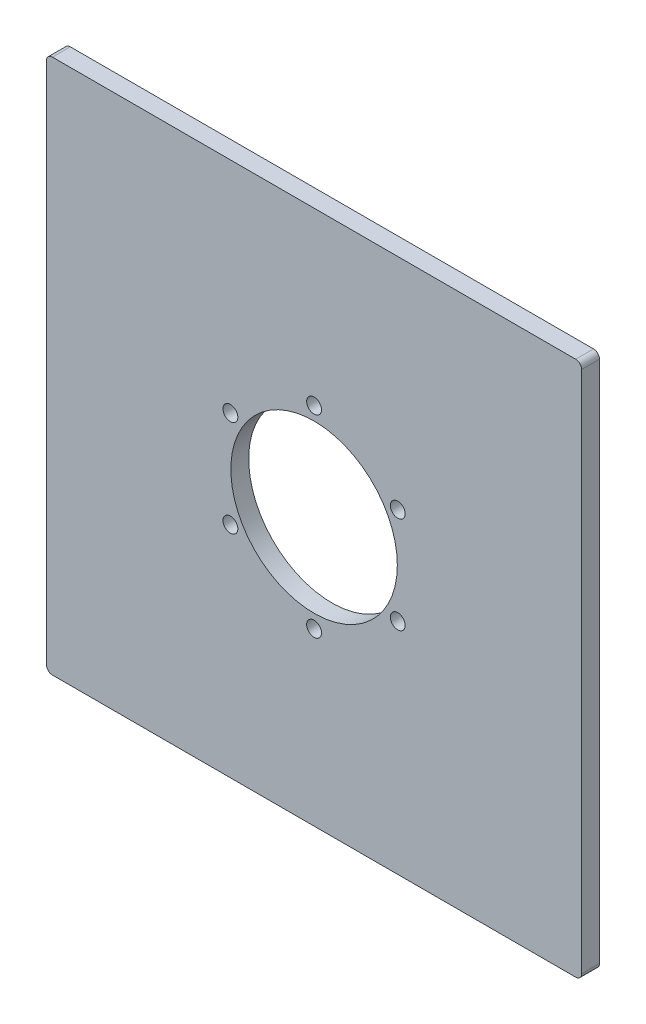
ISO-10303-21;
HEADER;
FILE_DESCRIPTION(('STEP AP214'),'2;1');
FILE_NAME('part.step','',(''),(''),'','','');
FILE_SCHEMA(('AUTOMOTIVE_DESIGN { 1 0 10303 214 1 1 1 1 }'));
ENDSEC;
DATA;
#1=APPLICATION_CONTEXT('core data for automotive mechanical design processes');
#2=APPLICATION_PROTOCOL_DEFINITION('international standard','automotive_design',2000,#1);
#3=PRODUCT_CONTEXT('',#1,'mechanical');
#4=PRODUCT('Part','Part','',(#3));
#5=PRODUCT_RELATED_PRODUCT_CATEGORY('part','',(#4));
#6=PRODUCT_DEFINITION_FORMATION('','',#4);
#7=PRODUCT_DEFINITION_CONTEXT('part definition',#1,'design');
#8=PRODUCT_DEFINITION('design','',#6,#7);
#9=PRODUCT_DEFINITION_SHAPE('','',#8);
#10=(LENGTH_UNIT() NAMED_UNIT(*) SI_UNIT(.MILLI.,.METRE.));
#11=(NAMED_UNIT(*) PLANE_ANGLE_UNIT() SI_UNIT($,.RADIAN.));
#12=(NAMED_UNIT(*) SI_UNIT($,.STERADIAN.) SOLID_ANGLE_UNIT());
#13=UNCERTAINTY_MEASURE_WITH_UNIT(LENGTH_MEASURE(1.E-05),#10,'distance_accuracy_value','');
#14=(GEOMETRIC_REPRESENTATION_CONTEXT(3) GLOBAL_UNCERTAINTY_ASSIGNED_CONTEXT((#13)) GLOBAL_UNIT_ASSIGNED_CONTEXT((#10,
#11,#12)) REPRESENTATION_CONTEXT('',''));
#15=CARTESIAN_POINT('',(0.,0.,0.));
#16=DIRECTION('',(0.,0.,1.));
#17=DIRECTION('',(1.,0.,0.));
#18=AXIS2_PLACEMENT_3D('',#15,#16,#17);
#19=CARTESIAN_POINT('',(114.3,-114.3,7.62));
#20=DIRECTION('',(-1.,0.,0.));
#21=DIRECTION('',(0.,0.,1.));
#22=AXIS2_PLACEMENT_3D('',#19,#20,#21);
#23=PLANE('',#22);
#24=DIRECTION('',(0.,1.,0.));
#25=VECTOR('',#24,1.);
#26=CARTESIAN_POINT('',(114.3,-114.3,7.62));
#27=LINE('',#26,#25);
#28=CARTESIAN_POINT('',(114.3,-111.76,7.62));
#29=VERTEX_POINT('',#28);
#30=CARTESIAN_POINT('',(114.3,111.76,7.62));
#31=VERTEX_POINT('',#30);
#32=EDGE_CURVE('E126',#29,#31,#27,.T.);
#33=ORIENTED_EDGE('',*,*,#32,.F.);
#34=DIRECTION('',(0.,0.,-1.));
#35=VECTOR('',#34,1.);
#36=CARTESIAN_POINT('',(114.3,-111.76,7.62));
#37=LINE('',#36,#35);
#38=CARTESIAN_POINT('',(114.3,-111.76,0.));
#39=VERTEX_POINT('',#38);
#40=EDGE_CURVE('E152',#29,#39,#37,.T.);
#41=ORIENTED_EDGE('',*,*,#40,.T.);
#42=DIRECTION('',(0.,1.,0.));
#43=VECTOR('',#42,1.);
#44=CARTESIAN_POINT('',(114.3,-114.3,0.));
#45=LINE('',#44,#43);
#46=CARTESIAN_POINT('',(114.3,111.76,0.));
#47=VERTEX_POINT('',#46);
#48=EDGE_CURVE('E158',#39,#47,#45,.T.);
#49=ORIENTED_EDGE('',*,*,#48,.T.);
#50=DIRECTION('',(0.,0.,-1.));
#51=VECTOR('',#50,1.);
#52=CARTESIAN_POINT('',(114.3,111.76,7.62));
#53=LINE('',#52,#51);
#54=EDGE_CURVE('E150',#47,#31,#53,.F.);
#55=ORIENTED_EDGE('',*,*,#54,.T.);
#56=EDGE_LOOP('',(#33,#41,#49,#55));
#57=FACE_BOUND('',#56,.T.);
#58=ADVANCED_FACE('F34',(#57),#23,.F.);
#59=CARTESIAN_POINT('',(-114.3,114.3,7.62));
#60=DIRECTION('',(0.,-1.,0.));
#61=DIRECTION('',(0.,0.,-1.));
#62=AXIS2_PLACEMENT_3D('',#59,#60,#61);
#63=PLANE('',#62);
#64=DIRECTION('',(-1.,0.,0.));
#65=VECTOR('',#64,1.);
#66=CARTESIAN_POINT('',(-114.3,114.3,7.62));
#67=LINE('',#66,#65);
#68=CARTESIAN_POINT('',(111.76,114.3,7.62));
#69=VERTEX_POINT('',#68);
#70=CARTESIAN_POINT('',(-111.76,114.3,7.62));
#71=VERTEX_POINT('',#70);
#72=EDGE_CURVE('E129',#69,#71,#67,.T.);
#73=ORIENTED_EDGE('',*,*,#72,.F.);
#74=DIRECTION('',(0.,0.,-1.));
#75=VECTOR('',#74,1.);
#76=CARTESIAN_POINT('',(111.76,114.3,7.62));
#77=LINE('',#76,#75);
#78=CARTESIAN_POINT('',(111.76,114.3,0.));
#79=VERTEX_POINT('',#78);
#80=EDGE_CURVE('E11',#69,#79,#77,.T.);
#81=ORIENTED_EDGE('',*,*,#80,.T.);
#82=DIRECTION('',(-1.,0.,0.));
#83=VECTOR('',#82,1.);
#84=CARTESIAN_POINT('',(-114.3,114.3,0.));
#85=LINE('',#84,#83);
#86=CARTESIAN_POINT('',(-111.76,114.3,0.));
#87=VERTEX_POINT('',#86);
#88=EDGE_CURVE('E131',#79,#87,#85,.T.);
#89=ORIENTED_EDGE('',*,*,#88,.T.);
#90=DIRECTION('',(0.,0.,-1.));
#91=VECTOR('',#90,1.);
#92=CARTESIAN_POINT('',(-111.76,114.3,7.62));
#93=LINE('',#92,#91);
#94=EDGE_CURVE('E42',#87,#71,#93,.F.);
#95=ORIENTED_EDGE('',*,*,#94,.T.);
#96=EDGE_LOOP('',(#73,#81,#89,#95));
#97=FACE_BOUND('',#96,.T.);
#98=ADVANCED_FACE('F239',(#97),#63,.F.);
#99=CARTESIAN_POINT('',(-114.3,-114.3,7.62));
#100=DIRECTION('',(1.,0.,0.));
#101=DIRECTION('',(0.,0.,-1.));
#102=AXIS2_PLACEMENT_3D('',#99,#100,#101);
#103=PLANE('',#102);
#104=DIRECTION('',(0.,-1.,0.));
#105=VECTOR('',#104,1.);
#106=CARTESIAN_POINT('',(-114.3,-114.3,0.));
#107=LINE('',#106,#105);
#108=CARTESIAN_POINT('',(-114.3,111.76,0.));
#109=VERTEX_POINT('',#108);
#110=CARTESIAN_POINT('',(-114.3,-111.76,0.));
#111=VERTEX_POINT('',#110);
#112=EDGE_CURVE('E127',#109,#111,#107,.T.);
#113=ORIENTED_EDGE('',*,*,#112,.T.);
#114=DIRECTION('',(0.,0.,-1.));
#115=VECTOR('',#114,1.);
#116=CARTESIAN_POINT('',(-114.3,-111.76,7.62));
#117=LINE('',#116,#115);
#118=CARTESIAN_POINT('',(-114.3,-111.76,7.62));
#119=VERTEX_POINT('',#118);
#120=EDGE_CURVE('E105',#111,#119,#117,.F.);
#121=ORIENTED_EDGE('',*,*,#120,.T.);
#122=DIRECTION('',(0.,-1.,0.));
#123=VECTOR('',#122,1.);
#124=CARTESIAN_POINT('',(-114.3,-114.3,7.62));
#125=LINE('',#124,#123);
#126=CARTESIAN_POINT('',(-114.3,111.76,7.62));
#127=VERTEX_POINT('',#126);
#128=EDGE_CURVE('E170',#127,#119,#125,.T.);
#129=ORIENTED_EDGE('',*,*,#128,.F.);
#130=DIRECTION('',(0.,0.,-1.));
#131=VECTOR('',#130,1.);
#132=CARTESIAN_POINT('',(-114.3,111.76,7.62));
#133=LINE('',#132,#131);
#134=EDGE_CURVE('E110',#127,#109,#133,.T.);
#135=ORIENTED_EDGE('',*,*,#134,.T.);
#136=EDGE_LOOP('',(#113,#121,#129,#135));
#137=FACE_BOUND('',#136,.T.);
#138=ADVANCED_FACE('F237',(#137),#103,.F.);
#139=CARTESIAN_POINT('',(-114.3,-114.3,7.62));
#140=DIRECTION('',(0.,1.,0.));
#141=DIRECTION('',(0.,0.,1.));
#142=AXIS2_PLACEMENT_3D('',#139,#140,#141);
#143=PLANE('',#142);
#144=DIRECTION('',(1.,0.,0.));
#145=VECTOR('',#144,1.);
#146=CARTESIAN_POINT('',(-114.3,-114.3,7.62));
#147=LINE('',#146,#145);
#148=CARTESIAN_POINT('',(-111.76,-114.3,7.62));
#149=VERTEX_POINT('',#148);
#150=CARTESIAN_POINT('',(111.76,-114.3,7.62));
#151=VERTEX_POINT('',#150);
#152=EDGE_CURVE('E120',#149,#151,#147,.T.);
#153=ORIENTED_EDGE('',*,*,#152,.F.);
#154=DIRECTION('',(0.,0.,-1.));
#155=VECTOR('',#154,1.);
#156=CARTESIAN_POINT('',(-111.76,-114.3,7.62));
#157=LINE('',#156,#155);
#158=CARTESIAN_POINT('',(-111.76,-114.3,0.));
#159=VERTEX_POINT('',#158);
#160=EDGE_CURVE('E104',#149,#159,#157,.T.);
#161=ORIENTED_EDGE('',*,*,#160,.T.);
#162=DIRECTION('',(1.,0.,0.));
#163=VECTOR('',#162,1.);
#164=CARTESIAN_POINT('',(-114.3,-114.3,0.));
#165=LINE('',#164,#163);
#166=CARTESIAN_POINT('',(111.76,-114.3,0.));
#167=VERTEX_POINT('',#166);
#168=EDGE_CURVE('E117',#159,#167,#165,.T.);
#169=ORIENTED_EDGE('',*,*,#168,.T.);
#170=DIRECTION('',(0.,0.,-1.));
#171=VECTOR('',#170,1.);
#172=CARTESIAN_POINT('',(111.76,-114.3,7.62));
#173=LINE('',#172,#171);
#174=EDGE_CURVE('E122',#167,#151,#173,.F.);
#175=ORIENTED_EDGE('',*,*,#174,.T.);
#176=EDGE_LOOP('',(#153,#161,#169,#175));
#177=FACE_BOUND('',#176,.T.);
#178=ADVANCED_FACE('F116',(#177),#143,.F.);
#179=CARTESIAN_POINT('',(0.,0.,7.62));
#180=DIRECTION('',(0.,0.,-1.));
#181=DIRECTION('',(-1.,0.,0.));
#182=AXIS2_PLACEMENT_3D('',#179,#180,#181);
#183=PLANE('',#182);
#184=CARTESIAN_POINT('',(35.7451985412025,20.6375000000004,7.62));
#185=DIRECTION('',(0.,0.,1.));
#186=DIRECTION('',(0.50000000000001,-0.866025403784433,0.));
#187=AXIS2_PLACEMENT_3D('',#184,#185,#186);
#188=CIRCLE('',#187,3.175);
#189=CARTESIAN_POINT('',(38.9201985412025,20.6375000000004,7.62));
#190=VERTEX_POINT('',#189);
#191=EDGE_CURVE('E189',#190,#190,#188,.T.);
#192=ORIENTED_EDGE('',*,*,#191,.F.);
#193=EDGE_LOOP('',(#192));
#194=FACE_BOUND('',#193,.T.);
#195=CARTESIAN_POINT('',(35.7451985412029,-20.6374999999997,7.62));
#196=DIRECTION('',(0.,0.,1.));
#197=DIRECTION('',(-0.499999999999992,-0.866025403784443,0.));
#198=AXIS2_PLACEMENT_3D('',#195,#196,#197);
#199=CIRCLE('',#198,3.175);
#200=CARTESIAN_POINT('',(38.9201985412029,-20.6374999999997,7.62));
#201=VERTEX_POINT('',#200);
#202=EDGE_CURVE('E195',#201,#201,#199,.T.);
#203=ORIENTED_EDGE('',*,*,#202,.F.);
#204=EDGE_LOOP('',(#203));
#205=FACE_BOUND('',#204,.T.);
#206=CARTESIAN_POINT('',(0.,-41.275,7.62));
#207=DIRECTION('',(0.,0.,1.));
#208=DIRECTION('',(-1.,0.,0.));
#209=AXIS2_PLACEMENT_3D('',#206,#207,#208);
#210=CIRCLE('',#209,3.175);
#211=CARTESIAN_POINT('',(3.175,-41.275,7.62));
#212=VERTEX_POINT('',#211);
#213=EDGE_CURVE('E201',#212,#212,#210,.T.);
#214=ORIENTED_EDGE('',*,*,#213,.F.);
#215=EDGE_LOOP('',(#214));
#216=FACE_BOUND('',#215,.T.);
#217=CARTESIAN_POINT('',(-35.7451985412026,-20.6375000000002,7.62));
#218=DIRECTION('',(0.,0.,1.));
#219=DIRECTION('',(-0.500000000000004,0.866025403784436,0.));
#220=AXIS2_PLACEMENT_3D('',#217,#218,#219);
#221=CIRCLE('',#220,3.175);
#222=CARTESIAN_POINT('',(-32.5701985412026,-20.6375000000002,7.62));
#223=VERTEX_POINT('',#222);
#224=EDGE_CURVE('E207',#223,#223,#221,.T.);
#225=ORIENTED_EDGE('',*,*,#224,.F.);
#226=EDGE_LOOP('',(#225));
#227=FACE_BOUND('',#226,.T.);
#228=CARTESIAN_POINT('',(-35.7451985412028,20.6374999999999,7.62));
#229=DIRECTION('',(0.,0.,1.));
#230=DIRECTION('',(0.499999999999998,0.86602540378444,0.));
#231=AXIS2_PLACEMENT_3D('',#228,#229,#230);
#232=CIRCLE('',#231,3.175);
#233=CARTESIAN_POINT('',(-32.5701985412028,20.6374999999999,7.62));
#234=VERTEX_POINT('',#233);
#235=EDGE_CURVE('E183',#234,#234,#232,.T.);
#236=ORIENTED_EDGE('',*,*,#235,.F.);
#237=EDGE_LOOP('',(#236));
#238=FACE_BOUND('',#237,.T.);
#239=CARTESIAN_POINT('',(0.,41.275,7.62));
#240=DIRECTION('',(0.,0.,1.));
#241=DIRECTION('',(1.,0.,0.));
#242=AXIS2_PLACEMENT_3D('',#239,#240,#241);
#243=CIRCLE('',#242,3.175);
#244=CARTESIAN_POINT('',(3.175,41.275,7.62));
#245=VERTEX_POINT('',#244);
#246=EDGE_CURVE('E177',#245,#245,#243,.T.);
#247=ORIENTED_EDGE('',*,*,#246,.F.);
#248=EDGE_LOOP('',(#247));
#249=FACE_BOUND('',#248,.T.);
#250=CARTESIAN_POINT('',(0.,0.,7.62));
#251=DIRECTION('',(0.,0.,1.));
#252=DIRECTION('',(1.,0.,0.));
#253=AXIS2_PLACEMENT_3D('',#250,#251,#252);
#254=CIRCLE('',#253,35.56);
#255=CARTESIAN_POINT('',(35.56,0.,7.62));
#256=VERTEX_POINT('',#255);
#257=EDGE_CURVE('E166',#256,#256,#254,.T.);
#258=ORIENTED_EDGE('',*,*,#257,.F.);
#259=EDGE_LOOP('',(#258));
#260=FACE_BOUND('',#259,.T.);
#261=ORIENTED_EDGE('',*,*,#128,.T.);
#262=CARTESIAN_POINT('',(-111.76,-111.76,7.62));
#263=DIRECTION('',(0.,0.,-1.));
#264=DIRECTION('',(-1.,0.,0.));
#265=AXIS2_PLACEMENT_3D('',#262,#263,#264);
#266=CIRCLE('',#265,2.54);
#267=EDGE_CURVE('E148',#119,#149,#266,.F.);
#268=ORIENTED_EDGE('',*,*,#267,.T.);
#269=ORIENTED_EDGE('',*,*,#152,.T.);
#270=CARTESIAN_POINT('',(111.76,-111.76,7.62));
#271=DIRECTION('',(0.,0.,-1.));
#272=DIRECTION('',(-1.,0.,0.));
#273=AXIS2_PLACEMENT_3D('',#270,#271,#272);
#274=CIRCLE('',#273,2.54);
#275=EDGE_CURVE('E146',#151,#29,#274,.F.);
#276=ORIENTED_EDGE('',*,*,#275,.T.);
#277=ORIENTED_EDGE('',*,*,#32,.T.);
#278=CARTESIAN_POINT('',(111.76,111.76,7.62));
#279=DIRECTION('',(0.,0.,-1.));
#280=DIRECTION('',(-1.,0.,0.));
#281=AXIS2_PLACEMENT_3D('',#278,#279,#280);
#282=CIRCLE('',#281,2.54);
#283=EDGE_CURVE('E55',#31,#69,#282,.F.);
#284=ORIENTED_EDGE('',*,*,#283,.T.);
#285=ORIENTED_EDGE('',*,*,#72,.T.);
#286=CARTESIAN_POINT('',(-111.76,111.76,7.62));
#287=DIRECTION('',(0.,0.,-1.));
#288=DIRECTION('',(-1.,0.,0.));
#289=AXIS2_PLACEMENT_3D('',#286,#287,#288);
#290=CIRCLE('',#289,2.54);
#291=EDGE_CURVE('E143',#71,#127,#290,.F.);
#292=ORIENTED_EDGE('',*,*,#291,.T.);
#293=EDGE_LOOP('',(#261,#268,#269,#276,#277,#284,#285,#292));
#294=FACE_BOUND('',#293,.T.);
#295=ADVANCED_FACE('F223',(#194,#205,#216,#227,#238,#249,#260,#294),#183,.F.);
#296=CARTESIAN_POINT('',(0.,0.,0.));
#297=DIRECTION('',(0.,0.,-1.));
#298=DIRECTION('',(-1.,0.,0.));
#299=AXIS2_PLACEMENT_3D('',#296,#297,#298);
#300=PLANE('',#299);
#301=CARTESIAN_POINT('',(35.7451985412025,20.6375000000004,0.));
#302=DIRECTION('',(0.,0.,1.));
#303=DIRECTION('',(0.50000000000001,-0.866025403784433,0.));
#304=AXIS2_PLACEMENT_3D('',#301,#302,#303);
#305=CIRCLE('',#304,3.175);
#306=CARTESIAN_POINT('',(38.9201985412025,20.6375000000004,0.));
#307=VERTEX_POINT('',#306);
#308=EDGE_CURVE('E192',#307,#307,#305,.T.);
#309=ORIENTED_EDGE('',*,*,#308,.T.);
#310=EDGE_LOOP('',(#309));
#311=FACE_BOUND('',#310,.T.);
#312=CARTESIAN_POINT('',(35.7451985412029,-20.6374999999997,0.));
#313=DIRECTION('',(0.,0.,1.));
#314=DIRECTION('',(-0.499999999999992,-0.866025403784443,0.));
#315=AXIS2_PLACEMENT_3D('',#312,#313,#314);
#316=CIRCLE('',#315,3.175);
#317=CARTESIAN_POINT('',(38.9201985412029,-20.6374999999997,0.));
#318=VERTEX_POINT('',#317);
#319=EDGE_CURVE('E198',#318,#318,#316,.T.);
#320=ORIENTED_EDGE('',*,*,#319,.T.);
#321=EDGE_LOOP('',(#320));
#322=FACE_BOUND('',#321,.T.);
#323=CARTESIAN_POINT('',(0.,-41.275,0.));
#324=DIRECTION('',(0.,0.,1.));
#325=DIRECTION('',(-1.,0.,0.));
#326=AXIS2_PLACEMENT_3D('',#323,#324,#325);
#327=CIRCLE('',#326,3.175);
#328=CARTESIAN_POINT('',(3.175,-41.275,0.));
#329=VERTEX_POINT('',#328);
#330=EDGE_CURVE('E204',#329,#329,#327,.T.);
#331=ORIENTED_EDGE('',*,*,#330,.T.);
#332=EDGE_LOOP('',(#331));
#333=FACE_BOUND('',#332,.T.);
#334=CARTESIAN_POINT('',(-35.7451985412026,-20.6375000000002,0.));
#335=DIRECTION('',(0.,0.,1.));
#336=DIRECTION('',(-0.500000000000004,0.866025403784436,0.));
#337=AXIS2_PLACEMENT_3D('',#334,#335,#336);
#338=CIRCLE('',#337,3.175);
#339=CARTESIAN_POINT('',(-32.5701985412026,-20.6375000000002,0.));
#340=VERTEX_POINT('',#339);
#341=EDGE_CURVE('E186',#340,#340,#338,.T.);
#342=ORIENTED_EDGE('',*,*,#341,.T.);
#343=EDGE_LOOP('',(#342));
#344=FACE_BOUND('',#343,.T.);
#345=CARTESIAN_POINT('',(-35.7451985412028,20.6374999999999,0.));
#346=DIRECTION('',(0.,0.,1.));
#347=DIRECTION('',(0.499999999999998,0.86602540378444,0.));
#348=AXIS2_PLACEMENT_3D('',#345,#346,#347);
#349=CIRCLE('',#348,3.175);
#350=CARTESIAN_POINT('',(-32.5701985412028,20.6374999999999,0.));
#351=VERTEX_POINT('',#350);
#352=EDGE_CURVE('E180',#351,#351,#349,.T.);
#353=ORIENTED_EDGE('',*,*,#352,.T.);
#354=EDGE_LOOP('',(#353));
#355=FACE_BOUND('',#354,.T.);
#356=CARTESIAN_POINT('',(0.,41.275,0.));
#357=DIRECTION('',(0.,0.,1.));
#358=DIRECTION('',(1.,0.,0.));
#359=AXIS2_PLACEMENT_3D('',#356,#357,#358);
#360=CIRCLE('',#359,3.175);
#361=CARTESIAN_POINT('',(3.175,41.275,0.));
#362=VERTEX_POINT('',#361);
#363=EDGE_CURVE('E175',#362,#362,#360,.T.);
#364=ORIENTED_EDGE('',*,*,#363,.T.);
#365=EDGE_LOOP('',(#364));
#366=FACE_BOUND('',#365,.T.);
#367=CARTESIAN_POINT('',(0.,0.,0.));
#368=DIRECTION('',(0.,0.,1.));
#369=DIRECTION('',(1.,0.,0.));
#370=AXIS2_PLACEMENT_3D('',#367,#368,#369);
#371=CIRCLE('',#370,35.56);
#372=CARTESIAN_POINT('',(35.56,0.,0.));
#373=VERTEX_POINT('',#372);
#374=EDGE_CURVE('E163',#373,#373,#371,.T.);
#375=ORIENTED_EDGE('',*,*,#374,.T.);
#376=EDGE_LOOP('',(#375));
#377=FACE_BOUND('',#376,.T.);
#378=ORIENTED_EDGE('',*,*,#168,.F.);
#379=CARTESIAN_POINT('',(-111.76,-111.76,0.));
#380=DIRECTION('',(0.,0.,-1.));
#381=DIRECTION('',(-1.,0.,0.));
#382=AXIS2_PLACEMENT_3D('',#379,#380,#381);
#383=CIRCLE('',#382,2.54);
#384=EDGE_CURVE('E100',#159,#111,#383,.T.);
#385=ORIENTED_EDGE('',*,*,#384,.T.);
#386=ORIENTED_EDGE('',*,*,#112,.F.);
#387=CARTESIAN_POINT('',(-111.76,111.76,0.));
#388=DIRECTION('',(0.,0.,-1.));
#389=DIRECTION('',(-1.,0.,0.));
#390=AXIS2_PLACEMENT_3D('',#387,#388,#389);
#391=CIRCLE('',#390,2.54);
#392=EDGE_CURVE('E121',#109,#87,#391,.T.);
#393=ORIENTED_EDGE('',*,*,#392,.T.);
#394=ORIENTED_EDGE('',*,*,#88,.F.);
#395=CARTESIAN_POINT('',(111.76,111.76,0.));
#396=DIRECTION('',(0.,0.,-1.));
#397=DIRECTION('',(-1.,0.,0.));
#398=AXIS2_PLACEMENT_3D('',#395,#396,#397);
#399=CIRCLE('',#398,2.54);
#400=EDGE_CURVE('E137',#79,#47,#399,.T.);
#401=ORIENTED_EDGE('',*,*,#400,.T.);
#402=ORIENTED_EDGE('',*,*,#48,.F.);
#403=CARTESIAN_POINT('',(111.76,-111.76,0.));
#404=DIRECTION('',(0.,0.,-1.));
#405=DIRECTION('',(-1.,0.,0.));
#406=AXIS2_PLACEMENT_3D('',#403,#404,#405);
#407=CIRCLE('',#406,2.54);
#408=EDGE_CURVE('E111',#39,#167,#407,.T.);
#409=ORIENTED_EDGE('',*,*,#408,.T.);
#410=EDGE_LOOP('',(#378,#385,#386,#393,#394,#401,#402,#409));
#411=FACE_BOUND('',#410,.T.);
#412=ADVANCED_FACE('F124',(#311,#322,#333,#344,#355,#366,#377,#411),#300,.T.);
#413=CARTESIAN_POINT('',(-111.76,-111.76,7.62));
#414=DIRECTION('',(0.,0.,-1.));
#415=DIRECTION('',(-1.,0.,0.));
#416=AXIS2_PLACEMENT_3D('',#413,#414,#415);
#417=CYLINDRICAL_SURFACE('',#416,2.54);
#418=ORIENTED_EDGE('',*,*,#267,.F.);
#419=ORIENTED_EDGE('',*,*,#120,.F.);
#420=ORIENTED_EDGE('',*,*,#384,.F.);
#421=ORIENTED_EDGE('',*,*,#160,.F.);
#422=EDGE_LOOP('',(#418,#419,#420,#421));
#423=FACE_BOUND('',#422,.T.);
#424=ADVANCED_FACE('F103',(#423),#417,.T.);
#425=CARTESIAN_POINT('',(111.76,-111.76,7.62));
#426=DIRECTION('',(0.,0.,-1.));
#427=DIRECTION('',(-1.,0.,0.));
#428=AXIS2_PLACEMENT_3D('',#425,#426,#427);
#429=CYLINDRICAL_SURFACE('',#428,2.54);
#430=ORIENTED_EDGE('',*,*,#275,.F.);
#431=ORIENTED_EDGE('',*,*,#174,.F.);
#432=ORIENTED_EDGE('',*,*,#408,.F.);
#433=ORIENTED_EDGE('',*,*,#40,.F.);
#434=EDGE_LOOP('',(#430,#431,#432,#433));
#435=FACE_BOUND('',#434,.T.);
#436=ADVANCED_FACE('F243',(#435),#429,.T.);
#437=CARTESIAN_POINT('',(111.76,111.76,7.62));
#438=DIRECTION('',(0.,0.,-1.));
#439=DIRECTION('',(-1.,0.,0.));
#440=AXIS2_PLACEMENT_3D('',#437,#438,#439);
#441=CYLINDRICAL_SURFACE('',#440,2.54);
#442=ORIENTED_EDGE('',*,*,#283,.F.);
#443=ORIENTED_EDGE('',*,*,#54,.F.);
#444=ORIENTED_EDGE('',*,*,#400,.F.);
#445=ORIENTED_EDGE('',*,*,#80,.F.);
#446=EDGE_LOOP('',(#442,#443,#444,#445));
#447=FACE_BOUND('',#446,.T.);
#448=ADVANCED_FACE('F242',(#447),#441,.T.);
#449=CARTESIAN_POINT('',(-111.76,111.76,7.62));
#450=DIRECTION('',(0.,0.,-1.));
#451=DIRECTION('',(-1.,0.,0.));
#452=AXIS2_PLACEMENT_3D('',#449,#450,#451);
#453=CYLINDRICAL_SURFACE('',#452,2.54);
#454=ORIENTED_EDGE('',*,*,#291,.F.);
#455=ORIENTED_EDGE('',*,*,#94,.F.);
#456=ORIENTED_EDGE('',*,*,#392,.F.);
#457=ORIENTED_EDGE('',*,*,#134,.F.);
#458=EDGE_LOOP('',(#454,#455,#456,#457));
#459=FACE_BOUND('',#458,.T.);
#460=ADVANCED_FACE('F36',(#459),#453,.T.);
#461=CARTESIAN_POINT('',(0.,0.,0.));
#462=DIRECTION('',(0.,0.,1.));
#463=DIRECTION('',(1.,0.,0.));
#464=AXIS2_PLACEMENT_3D('',#461,#462,#463);
#465=CYLINDRICAL_SURFACE('',#464,35.56);
#466=CARTESIAN_POINT('',(35.56,0.,0.));
#467=CARTESIAN_POINT('',(35.56,0.,0.0793749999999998));
#468=CARTESIAN_POINT('',(35.56,0.,0.15875));
#469=CARTESIAN_POINT('',(35.56,0.,0.3175));
#470=CARTESIAN_POINT('',(35.56,0.,0.396875));
#471=CARTESIAN_POINT('',(35.56,0.,0.555625));
#472=CARTESIAN_POINT('',(35.56,0.,0.635));
#473=CARTESIAN_POINT('',(35.56,0.,0.79375));
#474=CARTESIAN_POINT('',(35.56,0.,0.873125));
#475=CARTESIAN_POINT('',(35.56,0.,1.031875));
#476=CARTESIAN_POINT('',(35.56,0.,1.11125));
#477=CARTESIAN_POINT('',(35.56,0.,1.27));
#478=CARTESIAN_POINT('',(35.56,0.,1.349375));
#479=CARTESIAN_POINT('',(35.56,0.,1.508125));
#480=CARTESIAN_POINT('',(35.56,0.,1.5875));
#481=CARTESIAN_POINT('',(35.56,0.,1.74625));
#482=CARTESIAN_POINT('',(35.56,0.,1.825625));
#483=CARTESIAN_POINT('',(35.56,0.,1.984375));
#484=CARTESIAN_POINT('',(35.56,0.,2.06375));
#485=CARTESIAN_POINT('',(35.56,0.,2.2225));
#486=CARTESIAN_POINT('',(35.56,0.,2.301875));
#487=CARTESIAN_POINT('',(35.56,0.,2.460625));
#488=CARTESIAN_POINT('',(35.56,0.,2.54));
#489=CARTESIAN_POINT('',(35.56,0.,2.69875));
#490=CARTESIAN_POINT('',(35.56,0.,2.778125));
#491=CARTESIAN_POINT('',(35.56,0.,2.936875));
#492=CARTESIAN_POINT('',(35.56,0.,3.01625));
#493=CARTESIAN_POINT('',(35.56,0.,3.175));
#494=CARTESIAN_POINT('',(35.56,0.,3.254375));
#495=CARTESIAN_POINT('',(35.56,0.,3.413125));
#496=CARTESIAN_POINT('',(35.56,0.,3.4925));
#497=CARTESIAN_POINT('',(35.56,0.,3.65125));
#498=CARTESIAN_POINT('',(35.56,0.,3.730625));
#499=CARTESIAN_POINT('',(35.56,0.,3.889375));
#500=CARTESIAN_POINT('',(35.56,0.,3.96875));
#501=CARTESIAN_POINT('',(35.56,0.,4.1275));
#502=CARTESIAN_POINT('',(35.56,0.,4.206875));
#503=CARTESIAN_POINT('',(35.56,0.,4.365625));
#504=CARTESIAN_POINT('',(35.56,0.,4.445));
#505=CARTESIAN_POINT('',(35.56,0.,4.60375));
#506=CARTESIAN_POINT('',(35.56,0.,4.683125));
#507=CARTESIAN_POINT('',(35.56,0.,4.841875));
#508=CARTESIAN_POINT('',(35.56,0.,4.92125));
#509=CARTESIAN_POINT('',(35.56,0.,5.08));
#510=CARTESIAN_POINT('',(35.56,0.,5.159375));
#511=CARTESIAN_POINT('',(35.56,0.,5.318125));
#512=CARTESIAN_POINT('',(35.56,0.,5.3975));
#513=CARTESIAN_POINT('',(35.56,0.,5.55625));
#514=CARTESIAN_POINT('',(35.56,0.,5.635625));
#515=CARTESIAN_POINT('',(35.56,0.,5.794375));
#516=CARTESIAN_POINT('',(35.56,0.,5.87375));
#517=CARTESIAN_POINT('',(35.56,0.,6.0325));
#518=CARTESIAN_POINT('',(35.56,0.,6.111875));
#519=CARTESIAN_POINT('',(35.56,0.,6.270625));
#520=CARTESIAN_POINT('',(35.56,0.,6.35));
#521=CARTESIAN_POINT('',(35.56,0.,6.50875));
#522=CARTESIAN_POINT('',(35.56,0.,6.588125));
#523=CARTESIAN_POINT('',(35.56,0.,6.746875));
#524=CARTESIAN_POINT('',(35.56,0.,6.82625));
#525=CARTESIAN_POINT('',(35.56,0.,6.985));
#526=CARTESIAN_POINT('',(35.56,0.,7.064375));
#527=CARTESIAN_POINT('',(35.56,0.,7.223125));
#528=CARTESIAN_POINT('',(35.56,0.,7.3025));
#529=CARTESIAN_POINT('',(35.56,0.,7.46125));
#530=CARTESIAN_POINT('',(35.56,0.,7.540625));
#531=CARTESIAN_POINT('',(35.56,0.,7.62));
#532=B_SPLINE_CURVE_WITH_KNOTS('',3,(#466,#467,#468,#469,#470,#471,#472,#473,#474,#475,#476,
#477,#478,#479,#480,#481,#482,#483,#484,#485,#486,#487,#488,#489,#490,#491,#492,#493,#494,#495,
#496,#497,#498,#499,#500,#501,#502,#503,#504,#505,#506,#507,#508,#509,#510,#511,#512,#513,#514,
#515,#516,#517,#518,#519,#520,#521,#522,#523,#524,#525,#526,#527,#528,#529,#530,#531),
.UNSPECIFIED.,.F.,.F.,(4,2,2,2,2,2,2,2,2,2,2,2,2,2,2,2,2,2,2,2,2,2,2,2,2,2,2,2,2,2,2,2,4),(0.,
0.238125,0.47625,0.714375,0.9525,1.190625,1.42875,1.666875,1.905,2.143125,2.38125,2.619375,
2.8575,3.095625,3.33375,3.571875,3.81,4.048125,4.28625,4.524375,4.7625,5.000625,5.23875,
5.476875,5.715,5.953125,6.19125,6.429375,6.6675,6.905625,7.14375,7.381875,7.62),.UNSPECIFIED.);
#533=EDGE_CURVE('BSEAM265',#373,#256,#532,.T.);
#534=ORIENTED_EDGE('',*,*,#374,.F.);
#535=ORIENTED_EDGE('',*,*,#257,.T.);
#536=ORIENTED_EDGE('',*,*,#533,.T.);
#537=ORIENTED_EDGE('',*,*,#533,.F.);
#538=EDGE_LOOP('',(#534,#536,#535,#537));
#539=FACE_BOUND('',#538,.T.);
#540=ADVANCED_FACE('F265',(#539),#465,.F.);
#541=CARTESIAN_POINT('',(0.,41.275,0.));
#542=DIRECTION('',(0.,0.,1.));
#543=DIRECTION('',(1.,0.,0.));
#544=AXIS2_PLACEMENT_3D('',#541,#542,#543);
#545=CYLINDRICAL_SURFACE('',#544,3.175);
#546=CARTESIAN_POINT('',(3.175,41.275,0.));
#547=CARTESIAN_POINT('',(3.175,41.275,0.0793749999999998));
#548=CARTESIAN_POINT('',(3.175,41.275,0.15875));
#549=CARTESIAN_POINT('',(3.175,41.275,0.3175));
#550=CARTESIAN_POINT('',(3.175,41.275,0.396875));
#551=CARTESIAN_POINT('',(3.175,41.275,0.555625));
#552=CARTESIAN_POINT('',(3.175,41.275,0.635));
#553=CARTESIAN_POINT('',(3.175,41.275,0.79375));
#554=CARTESIAN_POINT('',(3.175,41.275,0.873125));
#555=CARTESIAN_POINT('',(3.175,41.275,1.031875));
#556=CARTESIAN_POINT('',(3.175,41.275,1.11125));
#557=CARTESIAN_POINT('',(3.175,41.275,1.27));
#558=CARTESIAN_POINT('',(3.175,41.275,1.349375));
#559=CARTESIAN_POINT('',(3.175,41.275,1.508125));
#560=CARTESIAN_POINT('',(3.175,41.275,1.5875));
#561=CARTESIAN_POINT('',(3.175,41.275,1.74625));
#562=CARTESIAN_POINT('',(3.175,41.275,1.825625));
#563=CARTESIAN_POINT('',(3.175,41.275,1.984375));
#564=CARTESIAN_POINT('',(3.175,41.275,2.06375));
#565=CARTESIAN_POINT('',(3.175,41.275,2.2225));
#566=CARTESIAN_POINT('',(3.175,41.275,2.301875));
#567=CARTESIAN_POINT('',(3.175,41.275,2.460625));
#568=CARTESIAN_POINT('',(3.175,41.275,2.54));
#569=CARTESIAN_POINT('',(3.175,41.275,2.69875));
#570=CARTESIAN_POINT('',(3.175,41.275,2.778125));
#571=CARTESIAN_POINT('',(3.175,41.275,2.936875));
#572=CARTESIAN_POINT('',(3.175,41.275,3.01625));
#573=CARTESIAN_POINT('',(3.175,41.275,3.175));
#574=CARTESIAN_POINT('',(3.175,41.275,3.254375));
#575=CARTESIAN_POINT('',(3.175,41.275,3.413125));
#576=CARTESIAN_POINT('',(3.175,41.275,3.4925));
#577=CARTESIAN_POINT('',(3.175,41.275,3.65125));
#578=CARTESIAN_POINT('',(3.175,41.275,3.730625));
#579=CARTESIAN_POINT('',(3.175,41.275,3.889375));
#580=CARTESIAN_POINT('',(3.175,41.275,3.96875));
#581=CARTESIAN_POINT('',(3.175,41.275,4.1275));
#582=CARTESIAN_POINT('',(3.175,41.275,4.206875));
#583=CARTESIAN_POINT('',(3.175,41.275,4.365625));
#584=CARTESIAN_POINT('',(3.175,41.275,4.445));
#585=CARTESIAN_POINT('',(3.175,41.275,4.60375));
#586=CARTESIAN_POINT('',(3.175,41.275,4.683125));
#587=CARTESIAN_POINT('',(3.175,41.275,4.841875));
#588=CARTESIAN_POINT('',(3.175,41.275,4.92125));
#589=CARTESIAN_POINT('',(3.175,41.275,5.08));
#590=CARTESIAN_POINT('',(3.175,41.275,5.159375));
#591=CARTESIAN_POINT('',(3.175,41.275,5.318125));
#592=CARTESIAN_POINT('',(3.175,41.275,5.3975));
#593=CARTESIAN_POINT('',(3.175,41.275,5.55625));
#594=CARTESIAN_POINT('',(3.175,41.275,5.635625));
#595=CARTESIAN_POINT('',(3.175,41.275,5.794375));
#596=CARTESIAN_POINT('',(3.175,41.275,5.87375));
#597=CARTESIAN_POINT('',(3.175,41.275,6.0325));
#598=CARTESIAN_POINT('',(3.175,41.275,6.111875));
#599=CARTESIAN_POINT('',(3.175,41.275,6.270625));
#600=CARTESIAN_POINT('',(3.175,41.275,6.35));
#601=CARTESIAN_POINT('',(3.175,41.275,6.50875));
#602=CARTESIAN_POINT('',(3.175,41.275,6.588125));
#603=CARTESIAN_POINT('',(3.175,41.275,6.746875));
#604=CARTESIAN_POINT('',(3.175,41.275,6.82625));
#605=CARTESIAN_POINT('',(3.175,41.275,6.985));
#606=CARTESIAN_POINT('',(3.175,41.275,7.064375));
#607=CARTESIAN_POINT('',(3.175,41.275,7.223125));
#608=CARTESIAN_POINT('',(3.175,41.275,7.3025));
#609=CARTESIAN_POINT('',(3.175,41.275,7.46125));
#610=CARTESIAN_POINT('',(3.175,41.275,7.540625));
#611=CARTESIAN_POINT('',(3.175,41.275,7.62));
#612=B_SPLINE_CURVE_WITH_KNOTS('',3,(#546,#547,#548,#549,#550,#551,#552,#553,#554,#555,#556,
#557,#558,#559,#560,#561,#562,#563,#564,#565,#566,#567,#568,#569,#570,#571,#572,#573,#574,#575,
#576,#577,#578,#579,#580,#581,#582,#583,#584,#585,#586,#587,#588,#589,#590,#591,#592,#593,#594,
#595,#596,#597,#598,#599,#600,#601,#602,#603,#604,#605,#606,#607,#608,#609,#610,#611),
.UNSPECIFIED.,.F.,.F.,(4,2,2,2,2,2,2,2,2,2,2,2,2,2,2,2,2,2,2,2,2,2,2,2,2,2,2,2,2,2,2,2,4),(0.,
0.238125,0.47625,0.714375,0.9525,1.190625,1.42875,1.666875,1.905,2.143125,2.38125,2.619375,
2.8575,3.095625,3.33375,3.571875,3.81,4.048125,4.28625,4.524375,4.7625,5.000625,5.23875,
5.476875,5.715,5.953125,6.19125,6.429375,6.6675,6.905625,7.14375,7.381875,7.62),.UNSPECIFIED.);
#613=EDGE_CURVE('BSEAM268',#362,#245,#612,.T.);
#614=ORIENTED_EDGE('',*,*,#363,.F.);
#615=ORIENTED_EDGE('',*,*,#246,.T.);
#616=ORIENTED_EDGE('',*,*,#613,.T.);
#617=ORIENTED_EDGE('',*,*,#613,.F.);
#618=EDGE_LOOP('',(#614,#616,#615,#617));
#619=FACE_BOUND('',#618,.T.);
#620=ADVANCED_FACE('F268',(#619),#545,.F.);
#621=CARTESIAN_POINT('',(-35.7451985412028,20.6374999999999,0.));
#622=DIRECTION('',(0.,0.,1.));
#623=DIRECTION('',(1.,0.,0.));
#624=AXIS2_PLACEMENT_3D('',#621,#622,#623);
#625=CYLINDRICAL_SURFACE('',#624,3.175);
#626=CARTESIAN_POINT('',(-32.5701985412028,20.6374999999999,0.));
#627=CARTESIAN_POINT('',(-32.5701985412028,20.6374999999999,0.0793749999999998));
#628=CARTESIAN_POINT('',(-32.5701985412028,20.6374999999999,0.15875));
#629=CARTESIAN_POINT('',(-32.5701985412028,20.6374999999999,0.3175));
#630=CARTESIAN_POINT('',(-32.5701985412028,20.6374999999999,0.396875));
#631=CARTESIAN_POINT('',(-32.5701985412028,20.6374999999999,0.555625));
#632=CARTESIAN_POINT('',(-32.5701985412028,20.6374999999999,0.635));
#633=CARTESIAN_POINT('',(-32.5701985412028,20.6374999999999,0.79375));
#634=CARTESIAN_POINT('',(-32.5701985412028,20.6374999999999,0.873125));
#635=CARTESIAN_POINT('',(-32.5701985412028,20.6374999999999,1.031875));
#636=CARTESIAN_POINT('',(-32.5701985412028,20.6374999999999,1.11125));
#637=CARTESIAN_POINT('',(-32.5701985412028,20.6374999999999,1.27));
#638=CARTESIAN_POINT('',(-32.5701985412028,20.6374999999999,1.349375));
#639=CARTESIAN_POINT('',(-32.5701985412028,20.6374999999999,1.508125));
#640=CARTESIAN_POINT('',(-32.5701985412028,20.6374999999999,1.5875));
#641=CARTESIAN_POINT('',(-32.5701985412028,20.6374999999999,1.74625));
#642=CARTESIAN_POINT('',(-32.5701985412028,20.6374999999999,1.825625));
#643=CARTESIAN_POINT('',(-32.5701985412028,20.6374999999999,1.984375));
#644=CARTESIAN_POINT('',(-32.5701985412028,20.6374999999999,2.06375));
#645=CARTESIAN_POINT('',(-32.5701985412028,20.6374999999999,2.2225));
#646=CARTESIAN_POINT('',(-32.5701985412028,20.6374999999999,2.301875));
#647=CARTESIAN_POINT('',(-32.5701985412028,20.6374999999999,2.460625));
#648=CARTESIAN_POINT('',(-32.5701985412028,20.6374999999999,2.54));
#649=CARTESIAN_POINT('',(-32.5701985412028,20.6374999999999,2.69875));
#650=CARTESIAN_POINT('',(-32.5701985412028,20.6374999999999,2.778125));
#651=CARTESIAN_POINT('',(-32.5701985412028,20.6374999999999,2.936875));
#652=CARTESIAN_POINT('',(-32.5701985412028,20.6374999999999,3.01625));
#653=CARTESIAN_POINT('',(-32.5701985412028,20.6374999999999,3.175));
#654=CARTESIAN_POINT('',(-32.5701985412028,20.6374999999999,3.254375));
#655=CARTESIAN_POINT('',(-32.5701985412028,20.6374999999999,3.413125));
#656=CARTESIAN_POINT('',(-32.5701985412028,20.6374999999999,3.4925));
#657=CARTESIAN_POINT('',(-32.5701985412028,20.6374999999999,3.65125));
#658=CARTESIAN_POINT('',(-32.5701985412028,20.6374999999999,3.730625));
#659=CARTESIAN_POINT('',(-32.5701985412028,20.6374999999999,3.889375));
#660=CARTESIAN_POINT('',(-32.5701985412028,20.6374999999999,3.96875));
#661=CARTESIAN_POINT('',(-32.5701985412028,20.6374999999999,4.1275));
#662=CARTESIAN_POINT('',(-32.5701985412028,20.6374999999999,4.206875));
#663=CARTESIAN_POINT('',(-32.5701985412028,20.6374999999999,4.365625));
#664=CARTESIAN_POINT('',(-32.5701985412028,20.6374999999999,4.445));
#665=CARTESIAN_POINT('',(-32.5701985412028,20.6374999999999,4.60375));
#666=CARTESIAN_POINT('',(-32.5701985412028,20.6374999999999,4.683125));
#667=CARTESIAN_POINT('',(-32.5701985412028,20.6374999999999,4.841875));
#668=CARTESIAN_POINT('',(-32.5701985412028,20.6374999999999,4.92125));
#669=CARTESIAN_POINT('',(-32.5701985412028,20.6374999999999,5.08));
#670=CARTESIAN_POINT('',(-32.5701985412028,20.6374999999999,5.159375));
#671=CARTESIAN_POINT('',(-32.5701985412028,20.6374999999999,5.318125));
#672=CARTESIAN_POINT('',(-32.5701985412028,20.6374999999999,5.3975));
#673=CARTESIAN_POINT('',(-32.5701985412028,20.6374999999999,5.55625));
#674=CARTESIAN_POINT('',(-32.5701985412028,20.6374999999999,5.635625));
#675=CARTESIAN_POINT('',(-32.5701985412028,20.6374999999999,5.794375));
#676=CARTESIAN_POINT('',(-32.5701985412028,20.6374999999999,5.87375));
#677=CARTESIAN_POINT('',(-32.5701985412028,20.6374999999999,6.0325));
#678=CARTESIAN_POINT('',(-32.5701985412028,20.6374999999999,6.111875));
#679=CARTESIAN_POINT('',(-32.5701985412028,20.6374999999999,6.270625));
#680=CARTESIAN_POINT('',(-32.5701985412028,20.6374999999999,6.35));
#681=CARTESIAN_POINT('',(-32.5701985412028,20.6374999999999,6.50875));
#682=CARTESIAN_POINT('',(-32.5701985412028,20.6374999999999,6.588125));
#683=CARTESIAN_POINT('',(-32.5701985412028,20.6374999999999,6.746875));
#684=CARTESIAN_POINT('',(-32.5701985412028,20.6374999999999,6.82625));
#685=CARTESIAN_POINT('',(-32.5701985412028,20.6374999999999,6.985));
#686=CARTESIAN_POINT('',(-32.5701985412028,20.6374999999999,7.064375));
#687=CARTESIAN_POINT('',(-32.5701985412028,20.6374999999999,7.223125));
#688=CARTESIAN_POINT('',(-32.5701985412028,20.6374999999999,7.3025));
#689=CARTESIAN_POINT('',(-32.5701985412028,20.6374999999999,7.46125));
#690=CARTESIAN_POINT('',(-32.5701985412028,20.6374999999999,7.540625));
#691=CARTESIAN_POINT('',(-32.5701985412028,20.6374999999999,7.62));
#692=B_SPLINE_CURVE_WITH_KNOTS('',3,(#626,#627,#628,#629,#630,#631,#632,#633,#634,#635,#636,
#637,#638,#639,#640,#641,#642,#643,#644,#645,#646,#647,#648,#649,#650,#651,#652,#653,#654,#655,
#656,#657,#658,#659,#660,#661,#662,#663,#664,#665,#666,#667,#668,#669,#670,#671,#672,#673,#674,
#675,#676,#677,#678,#679,#680,#681,#682,#683,#684,#685,#686,#687,#688,#689,#690,#691),
.UNSPECIFIED.,.F.,.F.,(4,2,2,2,2,2,2,2,2,2,2,2,2,2,2,2,2,2,2,2,2,2,2,2,2,2,2,2,2,2,2,2,4),(0.,
0.238125,0.47625,0.714375,0.9525,1.190625,1.42875,1.666875,1.905,2.143125,2.38125,2.619375,
2.8575,3.095625,3.33375,3.571875,3.81,4.048125,4.28625,4.524375,4.7625,5.000625,5.23875,
5.476875,5.715,5.953125,6.19125,6.429375,6.6675,6.905625,7.14375,7.381875,7.62),.UNSPECIFIED.);
#693=EDGE_CURVE('BSEAM219',#351,#234,#692,.T.);
#694=ORIENTED_EDGE('',*,*,#352,.F.);
#695=ORIENTED_EDGE('',*,*,#235,.T.);
#696=ORIENTED_EDGE('',*,*,#693,.T.);
#697=ORIENTED_EDGE('',*,*,#693,.F.);
#698=EDGE_LOOP('',(#694,#696,#695,#697));
#699=FACE_BOUND('',#698,.T.);
#700=ADVANCED_FACE('F219',(#699),#625,.F.);
#701=CARTESIAN_POINT('',(-35.7451985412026,-20.6375000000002,0.));
#702=DIRECTION('',(0.,0.,1.));
#703=DIRECTION('',(1.,0.,0.));
#704=AXIS2_PLACEMENT_3D('',#701,#702,#703);
#705=CYLINDRICAL_SURFACE('',#704,3.175);
#706=CARTESIAN_POINT('',(-32.5701985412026,-20.6375000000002,0.));
#707=CARTESIAN_POINT('',(-32.5701985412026,-20.6375000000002,0.0793749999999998));
#708=CARTESIAN_POINT('',(-32.5701985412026,-20.6375000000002,0.15875));
#709=CARTESIAN_POINT('',(-32.5701985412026,-20.6375000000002,0.3175));
#710=CARTESIAN_POINT('',(-32.5701985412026,-20.6375000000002,0.396875));
#711=CARTESIAN_POINT('',(-32.5701985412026,-20.6375000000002,0.555625));
#712=CARTESIAN_POINT('',(-32.5701985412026,-20.6375000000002,0.635));
#713=CARTESIAN_POINT('',(-32.5701985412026,-20.6375000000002,0.79375));
#714=CARTESIAN_POINT('',(-32.5701985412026,-20.6375000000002,0.873125));
#715=CARTESIAN_POINT('',(-32.5701985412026,-20.6375000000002,1.031875));
#716=CARTESIAN_POINT('',(-32.5701985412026,-20.6375000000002,1.11125));
#717=CARTESIAN_POINT('',(-32.5701985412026,-20.6375000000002,1.27));
#718=CARTESIAN_POINT('',(-32.5701985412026,-20.6375000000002,1.349375));
#719=CARTESIAN_POINT('',(-32.5701985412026,-20.6375000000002,1.508125));
#720=CARTESIAN_POINT('',(-32.5701985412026,-20.6375000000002,1.5875));
#721=CARTESIAN_POINT('',(-32.5701985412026,-20.6375000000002,1.74625));
#722=CARTESIAN_POINT('',(-32.5701985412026,-20.6375000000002,1.825625));
#723=CARTESIAN_POINT('',(-32.5701985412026,-20.6375000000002,1.984375));
#724=CARTESIAN_POINT('',(-32.5701985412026,-20.6375000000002,2.06375));
#725=CARTESIAN_POINT('',(-32.5701985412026,-20.6375000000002,2.2225));
#726=CARTESIAN_POINT('',(-32.5701985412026,-20.6375000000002,2.301875));
#727=CARTESIAN_POINT('',(-32.5701985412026,-20.6375000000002,2.460625));
#728=CARTESIAN_POINT('',(-32.5701985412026,-20.6375000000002,2.54));
#729=CARTESIAN_POINT('',(-32.5701985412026,-20.6375000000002,2.69875));
#730=CARTESIAN_POINT('',(-32.5701985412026,-20.6375000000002,2.778125));
#731=CARTESIAN_POINT('',(-32.5701985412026,-20.6375000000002,2.936875));
#732=CARTESIAN_POINT('',(-32.5701985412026,-20.6375000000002,3.01625));
#733=CARTESIAN_POINT('',(-32.5701985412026,-20.6375000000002,3.175));
#734=CARTESIAN_POINT('',(-32.5701985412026,-20.6375000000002,3.254375));
#735=CARTESIAN_POINT('',(-32.5701985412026,-20.6375000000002,3.413125));
#736=CARTESIAN_POINT('',(-32.5701985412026,-20.6375000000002,3.4925));
#737=CARTESIAN_POINT('',(-32.5701985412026,-20.6375000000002,3.65125));
#738=CARTESIAN_POINT('',(-32.5701985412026,-20.6375000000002,3.730625));
#739=CARTESIAN_POINT('',(-32.5701985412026,-20.6375000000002,3.889375));
#740=CARTESIAN_POINT('',(-32.5701985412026,-20.6375000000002,3.96875));
#741=CARTESIAN_POINT('',(-32.5701985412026,-20.6375000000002,4.1275));
#742=CARTESIAN_POINT('',(-32.5701985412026,-20.6375000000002,4.206875));
#743=CARTESIAN_POINT('',(-32.5701985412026,-20.6375000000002,4.365625));
#744=CARTESIAN_POINT('',(-32.5701985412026,-20.6375000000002,4.445));
#745=CARTESIAN_POINT('',(-32.5701985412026,-20.6375000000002,4.60375));
#746=CARTESIAN_POINT('',(-32.5701985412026,-20.6375000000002,4.683125));
#747=CARTESIAN_POINT('',(-32.5701985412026,-20.6375000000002,4.841875));
#748=CARTESIAN_POINT('',(-32.5701985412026,-20.6375000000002,4.92125));
#749=CARTESIAN_POINT('',(-32.5701985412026,-20.6375000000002,5.08));
#750=CARTESIAN_POINT('',(-32.5701985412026,-20.6375000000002,5.159375));
#751=CARTESIAN_POINT('',(-32.5701985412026,-20.6375000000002,5.318125));
#752=CARTESIAN_POINT('',(-32.5701985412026,-20.6375000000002,5.3975));
#753=CARTESIAN_POINT('',(-32.5701985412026,-20.6375000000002,5.55625));
#754=CARTESIAN_POINT('',(-32.5701985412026,-20.6375000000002,5.635625));
#755=CARTESIAN_POINT('',(-32.5701985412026,-20.6375000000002,5.794375));
#756=CARTESIAN_POINT('',(-32.5701985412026,-20.6375000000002,5.87375));
#757=CARTESIAN_POINT('',(-32.5701985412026,-20.6375000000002,6.0325));
#758=CARTESIAN_POINT('',(-32.5701985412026,-20.6375000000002,6.111875));
#759=CARTESIAN_POINT('',(-32.5701985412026,-20.6375000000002,6.270625));
#760=CARTESIAN_POINT('',(-32.5701985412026,-20.6375000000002,6.35));
#761=CARTESIAN_POINT('',(-32.5701985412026,-20.6375000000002,6.50875));
#762=CARTESIAN_POINT('',(-32.5701985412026,-20.6375000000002,6.588125));
#763=CARTESIAN_POINT('',(-32.5701985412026,-20.6375000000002,6.746875));
#764=CARTESIAN_POINT('',(-32.5701985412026,-20.6375000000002,6.82625));
#765=CARTESIAN_POINT('',(-32.5701985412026,-20.6375000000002,6.985));
#766=CARTESIAN_POINT('',(-32.5701985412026,-20.6375000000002,7.064375));
#767=CARTESIAN_POINT('',(-32.5701985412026,-20.6375000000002,7.223125));
#768=CARTESIAN_POINT('',(-32.5701985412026,-20.6375000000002,7.3025));
#769=CARTESIAN_POINT('',(-32.5701985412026,-20.6375000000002,7.46125));
#770=CARTESIAN_POINT('',(-32.5701985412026,-20.6375000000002,7.540625));
#771=CARTESIAN_POINT('',(-32.5701985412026,-20.6375000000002,7.62));
#772=B_SPLINE_CURVE_WITH_KNOTS('',3,(#706,#707,#708,#709,#710,#711,#712,#713,#714,#715,#716,
#717,#718,#719,#720,#721,#722,#723,#724,#725,#726,#727,#728,#729,#730,#731,#732,#733,#734,#735,
#736,#737,#738,#739,#740,#741,#742,#743,#744,#745,#746,#747,#748,#749,#750,#751,#752,#753,#754,
#755,#756,#757,#758,#759,#760,#761,#762,#763,#764,#765,#766,#767,#768,#769,#770,#771),
.UNSPECIFIED.,.F.,.F.,(4,2,2,2,2,2,2,2,2,2,2,2,2,2,2,2,2,2,2,2,2,2,2,2,2,2,2,2,2,2,2,2,4),(0.,
0.238125,0.47625,0.714375,0.9525,1.190625,1.42875,1.666875,1.905,2.143125,2.38125,2.619375,
2.8575,3.095625,3.33375,3.571875,3.81,4.048125,4.28625,4.524375,4.7625,5.000625,5.23875,
5.476875,5.715,5.953125,6.19125,6.429375,6.6675,6.905625,7.14375,7.381875,7.62),.UNSPECIFIED.);
#773=EDGE_CURVE('BSEAM215',#340,#223,#772,.T.);
#774=ORIENTED_EDGE('',*,*,#341,.F.);
#775=ORIENTED_EDGE('',*,*,#224,.T.);
#776=ORIENTED_EDGE('',*,*,#773,.T.);
#777=ORIENTED_EDGE('',*,*,#773,.F.);
#778=EDGE_LOOP('',(#774,#776,#775,#777));
#779=FACE_BOUND('',#778,.T.);
#780=ADVANCED_FACE('F215',(#779),#705,.F.);
#781=CARTESIAN_POINT('',(0.,-41.275,0.));
#782=DIRECTION('',(0.,0.,1.));
#783=DIRECTION('',(1.,0.,0.));
#784=AXIS2_PLACEMENT_3D('',#781,#782,#783);
#785=CYLINDRICAL_SURFACE('',#784,3.175);
#786=CARTESIAN_POINT('',(3.175,-41.275,0.));
#787=CARTESIAN_POINT('',(3.175,-41.275,0.0793749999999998));
#788=CARTESIAN_POINT('',(3.175,-41.275,0.15875));
#789=CARTESIAN_POINT('',(3.175,-41.275,0.3175));
#790=CARTESIAN_POINT('',(3.175,-41.275,0.396875));
#791=CARTESIAN_POINT('',(3.175,-41.275,0.555625));
#792=CARTESIAN_POINT('',(3.175,-41.275,0.635));
#793=CARTESIAN_POINT('',(3.175,-41.275,0.79375));
#794=CARTESIAN_POINT('',(3.175,-41.275,0.873125));
#795=CARTESIAN_POINT('',(3.175,-41.275,1.031875));
#796=CARTESIAN_POINT('',(3.175,-41.275,1.11125));
#797=CARTESIAN_POINT('',(3.175,-41.275,1.27));
#798=CARTESIAN_POINT('',(3.175,-41.275,1.349375));
#799=CARTESIAN_POINT('',(3.175,-41.275,1.508125));
#800=CARTESIAN_POINT('',(3.175,-41.275,1.5875));
#801=CARTESIAN_POINT('',(3.175,-41.275,1.74625));
#802=CARTESIAN_POINT('',(3.175,-41.275,1.825625));
#803=CARTESIAN_POINT('',(3.175,-41.275,1.984375));
#804=CARTESIAN_POINT('',(3.175,-41.275,2.06375));
#805=CARTESIAN_POINT('',(3.175,-41.275,2.2225));
#806=CARTESIAN_POINT('',(3.175,-41.275,2.301875));
#807=CARTESIAN_POINT('',(3.175,-41.275,2.460625));
#808=CARTESIAN_POINT('',(3.175,-41.275,2.54));
#809=CARTESIAN_POINT('',(3.175,-41.275,2.69875));
#810=CARTESIAN_POINT('',(3.175,-41.275,2.778125));
#811=CARTESIAN_POINT('',(3.175,-41.275,2.936875));
#812=CARTESIAN_POINT('',(3.175,-41.275,3.01625));
#813=CARTESIAN_POINT('',(3.175,-41.275,3.175));
#814=CARTESIAN_POINT('',(3.175,-41.275,3.254375));
#815=CARTESIAN_POINT('',(3.175,-41.275,3.413125));
#816=CARTESIAN_POINT('',(3.175,-41.275,3.4925));
#817=CARTESIAN_POINT('',(3.175,-41.275,3.65125));
#818=CARTESIAN_POINT('',(3.175,-41.275,3.730625));
#819=CARTESIAN_POINT('',(3.175,-41.275,3.889375));
#820=CARTESIAN_POINT('',(3.175,-41.275,3.96875));
#821=CARTESIAN_POINT('',(3.175,-41.275,4.1275));
#822=CARTESIAN_POINT('',(3.175,-41.275,4.206875));
#823=CARTESIAN_POINT('',(3.175,-41.275,4.365625));
#824=CARTESIAN_POINT('',(3.175,-41.275,4.445));
#825=CARTESIAN_POINT('',(3.175,-41.275,4.60375));
#826=CARTESIAN_POINT('',(3.175,-41.275,4.683125));
#827=CARTESIAN_POINT('',(3.175,-41.275,4.841875));
#828=CARTESIAN_POINT('',(3.175,-41.275,4.92125));
#829=CARTESIAN_POINT('',(3.175,-41.275,5.08));
#830=CARTESIAN_POINT('',(3.175,-41.275,5.159375));
#831=CARTESIAN_POINT('',(3.175,-41.275,5.318125));
#832=CARTESIAN_POINT('',(3.175,-41.275,5.3975));
#833=CARTESIAN_POINT('',(3.175,-41.275,5.55625));
#834=CARTESIAN_POINT('',(3.175,-41.275,5.635625));
#835=CARTESIAN_POINT('',(3.175,-41.275,5.794375));
#836=CARTESIAN_POINT('',(3.175,-41.275,5.87375));
#837=CARTESIAN_POINT('',(3.175,-41.275,6.0325));
#838=CARTESIAN_POINT('',(3.175,-41.275,6.111875));
#839=CARTESIAN_POINT('',(3.175,-41.275,6.270625));
#840=CARTESIAN_POINT('',(3.175,-41.275,6.35));
#841=CARTESIAN_POINT('',(3.175,-41.275,6.50875));
#842=CARTESIAN_POINT('',(3.175,-41.275,6.588125));
#843=CARTESIAN_POINT('',(3.175,-41.275,6.746875));
#844=CARTESIAN_POINT('',(3.175,-41.275,6.82625));
#845=CARTESIAN_POINT('',(3.175,-41.275,6.985));
#846=CARTESIAN_POINT('',(3.175,-41.275,7.064375));
#847=CARTESIAN_POINT('',(3.175,-41.275,7.223125));
#848=CARTESIAN_POINT('',(3.175,-41.275,7.3025));
#849=CARTESIAN_POINT('',(3.175,-41.275,7.46125));
#850=CARTESIAN_POINT('',(3.175,-41.275,7.540625));
#851=CARTESIAN_POINT('',(3.175,-41.275,7.62));
#852=B_SPLINE_CURVE_WITH_KNOTS('',3,(#786,#787,#788,#789,#790,#791,#792,#793,#794,#795,#796,
#797,#798,#799,#800,#801,#802,#803,#804,#805,#806,#807,#808,#809,#810,#811,#812,#813,#814,#815,
#816,#817,#818,#819,#820,#821,#822,#823,#824,#825,#826,#827,#828,#829,#830,#831,#832,#833,#834,
#835,#836,#837,#838,#839,#840,#841,#842,#843,#844,#845,#846,#847,#848,#849,#850,#851),
.UNSPECIFIED.,.F.,.F.,(4,2,2,2,2,2,2,2,2,2,2,2,2,2,2,2,2,2,2,2,2,2,2,2,2,2,2,2,2,2,2,2,4),(0.,
0.238125,0.47625,0.714375,0.9525,1.190625,1.42875,1.666875,1.905,2.143125,2.38125,2.619375,
2.8575,3.095625,3.33375,3.571875,3.81,4.048125,4.28625,4.524375,4.7625,5.000625,5.23875,
5.476875,5.715,5.953125,6.19125,6.429375,6.6675,6.905625,7.14375,7.381875,7.62),.UNSPECIFIED.);
#853=EDGE_CURVE('BSEAM218',#329,#212,#852,.T.);
#854=ORIENTED_EDGE('',*,*,#330,.F.);
#855=ORIENTED_EDGE('',*,*,#213,.T.);
#856=ORIENTED_EDGE('',*,*,#853,.T.);
#857=ORIENTED_EDGE('',*,*,#853,.F.);
#858=EDGE_LOOP('',(#854,#856,#855,#857));
#859=FACE_BOUND('',#858,.T.);
#860=ADVANCED_FACE('F218',(#859),#785,.F.);
#861=CARTESIAN_POINT('',(35.7451985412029,-20.6374999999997,0.));
#862=DIRECTION('',(0.,0.,1.));
#863=DIRECTION('',(1.,0.,0.));
#864=AXIS2_PLACEMENT_3D('',#861,#862,#863);
#865=CYLINDRICAL_SURFACE('',#864,3.175);
#866=CARTESIAN_POINT('',(38.9201985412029,-20.6374999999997,0.));
#867=CARTESIAN_POINT('',(38.9201985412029,-20.6374999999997,0.0793749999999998));
#868=CARTESIAN_POINT('',(38.9201985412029,-20.6374999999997,0.15875));
#869=CARTESIAN_POINT('',(38.9201985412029,-20.6374999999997,0.3175));
#870=CARTESIAN_POINT('',(38.9201985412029,-20.6374999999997,0.396875));
#871=CARTESIAN_POINT('',(38.9201985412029,-20.6374999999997,0.555625));
#872=CARTESIAN_POINT('',(38.9201985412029,-20.6374999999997,0.635));
#873=CARTESIAN_POINT('',(38.9201985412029,-20.6374999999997,0.79375));
#874=CARTESIAN_POINT('',(38.9201985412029,-20.6374999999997,0.873125));
#875=CARTESIAN_POINT('',(38.9201985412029,-20.6374999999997,1.031875));
#876=CARTESIAN_POINT('',(38.9201985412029,-20.6374999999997,1.11125));
#877=CARTESIAN_POINT('',(38.9201985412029,-20.6374999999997,1.27));
#878=CARTESIAN_POINT('',(38.9201985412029,-20.6374999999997,1.349375));
#879=CARTESIAN_POINT('',(38.9201985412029,-20.6374999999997,1.508125));
#880=CARTESIAN_POINT('',(38.9201985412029,-20.6374999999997,1.5875));
#881=CARTESIAN_POINT('',(38.9201985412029,-20.6374999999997,1.74625));
#882=CARTESIAN_POINT('',(38.9201985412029,-20.6374999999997,1.825625));
#883=CARTESIAN_POINT('',(38.9201985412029,-20.6374999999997,1.984375));
#884=CARTESIAN_POINT('',(38.9201985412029,-20.6374999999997,2.06375));
#885=CARTESIAN_POINT('',(38.9201985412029,-20.6374999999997,2.2225));
#886=CARTESIAN_POINT('',(38.9201985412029,-20.6374999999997,2.301875));
#887=CARTESIAN_POINT('',(38.9201985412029,-20.6374999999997,2.460625));
#888=CARTESIAN_POINT('',(38.9201985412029,-20.6374999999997,2.54));
#889=CARTESIAN_POINT('',(38.9201985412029,-20.6374999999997,2.69875));
#890=CARTESIAN_POINT('',(38.9201985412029,-20.6374999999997,2.778125));
#891=CARTESIAN_POINT('',(38.9201985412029,-20.6374999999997,2.936875));
#892=CARTESIAN_POINT('',(38.9201985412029,-20.6374999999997,3.01625));
#893=CARTESIAN_POINT('',(38.9201985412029,-20.6374999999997,3.175));
#894=CARTESIAN_POINT('',(38.9201985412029,-20.6374999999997,3.254375));
#895=CARTESIAN_POINT('',(38.9201985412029,-20.6374999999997,3.413125));
#896=CARTESIAN_POINT('',(38.9201985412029,-20.6374999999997,3.4925));
#897=CARTESIAN_POINT('',(38.9201985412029,-20.6374999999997,3.65125));
#898=CARTESIAN_POINT('',(38.9201985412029,-20.6374999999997,3.730625));
#899=CARTESIAN_POINT('',(38.9201985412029,-20.6374999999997,3.889375));
#900=CARTESIAN_POINT('',(38.9201985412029,-20.6374999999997,3.96875));
#901=CARTESIAN_POINT('',(38.9201985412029,-20.6374999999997,4.1275));
#902=CARTESIAN_POINT('',(38.9201985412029,-20.6374999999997,4.206875));
#903=CARTESIAN_POINT('',(38.9201985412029,-20.6374999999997,4.365625));
#904=CARTESIAN_POINT('',(38.9201985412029,-20.6374999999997,4.445));
#905=CARTESIAN_POINT('',(38.9201985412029,-20.6374999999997,4.60375));
#906=CARTESIAN_POINT('',(38.9201985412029,-20.6374999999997,4.683125));
#907=CARTESIAN_POINT('',(38.9201985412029,-20.6374999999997,4.841875));
#908=CARTESIAN_POINT('',(38.9201985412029,-20.6374999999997,4.92125));
#909=CARTESIAN_POINT('',(38.9201985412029,-20.6374999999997,5.08));
#910=CARTESIAN_POINT('',(38.9201985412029,-20.6374999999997,5.159375));
#911=CARTESIAN_POINT('',(38.9201985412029,-20.6374999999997,5.318125));
#912=CARTESIAN_POINT('',(38.9201985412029,-20.6374999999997,5.3975));
#913=CARTESIAN_POINT('',(38.9201985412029,-20.6374999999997,5.55625));
#914=CARTESIAN_POINT('',(38.9201985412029,-20.6374999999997,5.635625));
#915=CARTESIAN_POINT('',(38.9201985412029,-20.6374999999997,5.794375));
#916=CARTESIAN_POINT('',(38.9201985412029,-20.6374999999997,5.87375));
#917=CARTESIAN_POINT('',(38.9201985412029,-20.6374999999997,6.0325));
#918=CARTESIAN_POINT('',(38.9201985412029,-20.6374999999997,6.111875));
#919=CARTESIAN_POINT('',(38.9201985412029,-20.6374999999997,6.270625));
#920=CARTESIAN_POINT('',(38.9201985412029,-20.6374999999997,6.35));
#921=CARTESIAN_POINT('',(38.9201985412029,-20.6374999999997,6.50875));
#922=CARTESIAN_POINT('',(38.9201985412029,-20.6374999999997,6.588125));
#923=CARTESIAN_POINT('',(38.9201985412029,-20.6374999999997,6.746875));
#924=CARTESIAN_POINT('',(38.9201985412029,-20.6374999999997,6.82625));
#925=CARTESIAN_POINT('',(38.9201985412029,-20.6374999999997,6.985));
#926=CARTESIAN_POINT('',(38.9201985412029,-20.6374999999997,7.064375));
#927=CARTESIAN_POINT('',(38.9201985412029,-20.6374999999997,7.223125));
#928=CARTESIAN_POINT('',(38.9201985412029,-20.6374999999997,7.3025));
#929=CARTESIAN_POINT('',(38.9201985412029,-20.6374999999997,7.46125));
#930=CARTESIAN_POINT('',(38.9201985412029,-20.6374999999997,7.540625));
#931=CARTESIAN_POINT('',(38.9201985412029,-20.6374999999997,7.62));
#932=B_SPLINE_CURVE_WITH_KNOTS('',3,(#866,#867,#868,#869,#870,#871,#872,#873,#874,#875,#876,
#877,#878,#879,#880,#881,#882,#883,#884,#885,#886,#887,#888,#889,#890,#891,#892,#893,#894,#895,
#896,#897,#898,#899,#900,#901,#902,#903,#904,#905,#906,#907,#908,#909,#910,#911,#912,#913,#914,
#915,#916,#917,#918,#919,#920,#921,#922,#923,#924,#925,#926,#927,#928,#929,#930,#931),
.UNSPECIFIED.,.F.,.F.,(4,2,2,2,2,2,2,2,2,2,2,2,2,2,2,2,2,2,2,2,2,2,2,2,2,2,2,2,2,2,2,2,4),(0.,
0.238125,0.47625,0.714375,0.9525,1.190625,1.42875,1.666875,1.905,2.143125,2.38125,2.619375,
2.8575,3.095625,3.33375,3.571875,3.81,4.048125,4.28625,4.524375,4.7625,5.000625,5.23875,
5.476875,5.715,5.953125,6.19125,6.429375,6.6675,6.905625,7.14375,7.381875,7.62),.UNSPECIFIED.);
#933=EDGE_CURVE('BSEAM279',#318,#201,#932,.T.);
#934=ORIENTED_EDGE('',*,*,#319,.F.);
#935=ORIENTED_EDGE('',*,*,#202,.T.);
#936=ORIENTED_EDGE('',*,*,#933,.T.);
#937=ORIENTED_EDGE('',*,*,#933,.F.);
#938=EDGE_LOOP('',(#934,#936,#935,#937));
#939=FACE_BOUND('',#938,.T.);
#940=ADVANCED_FACE('F279',(#939),#865,.F.);
#941=CARTESIAN_POINT('',(35.7451985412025,20.6375000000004,0.));
#942=DIRECTION('',(0.,0.,1.));
#943=DIRECTION('',(1.,0.,0.));
#944=AXIS2_PLACEMENT_3D('',#941,#942,#943);
#945=CYLINDRICAL_SURFACE('',#944,3.175);
#946=CARTESIAN_POINT('',(38.9201985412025,20.6375000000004,0.));
#947=CARTESIAN_POINT('',(38.9201985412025,20.6375000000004,0.0793749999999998));
#948=CARTESIAN_POINT('',(38.9201985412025,20.6375000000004,0.15875));
#949=CARTESIAN_POINT('',(38.9201985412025,20.6375000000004,0.3175));
#950=CARTESIAN_POINT('',(38.9201985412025,20.6375000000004,0.396875));
#951=CARTESIAN_POINT('',(38.9201985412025,20.6375000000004,0.555625));
#952=CARTESIAN_POINT('',(38.9201985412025,20.6375000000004,0.635));
#953=CARTESIAN_POINT('',(38.9201985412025,20.6375000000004,0.79375));
#954=CARTESIAN_POINT('',(38.9201985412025,20.6375000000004,0.873125));
#955=CARTESIAN_POINT('',(38.9201985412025,20.6375000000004,1.031875));
#956=CARTESIAN_POINT('',(38.9201985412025,20.6375000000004,1.11125));
#957=CARTESIAN_POINT('',(38.9201985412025,20.6375000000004,1.27));
#958=CARTESIAN_POINT('',(38.9201985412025,20.6375000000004,1.349375));
#959=CARTESIAN_POINT('',(38.9201985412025,20.6375000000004,1.508125));
#960=CARTESIAN_POINT('',(38.9201985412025,20.6375000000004,1.5875));
#961=CARTESIAN_POINT('',(38.9201985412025,20.6375000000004,1.74625));
#962=CARTESIAN_POINT('',(38.9201985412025,20.6375000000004,1.825625));
#963=CARTESIAN_POINT('',(38.9201985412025,20.6375000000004,1.984375));
#964=CARTESIAN_POINT('',(38.9201985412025,20.6375000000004,2.06375));
#965=CARTESIAN_POINT('',(38.9201985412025,20.6375000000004,2.2225));
#966=CARTESIAN_POINT('',(38.9201985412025,20.6375000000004,2.301875));
#967=CARTESIAN_POINT('',(38.9201985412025,20.6375000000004,2.460625));
#968=CARTESIAN_POINT('',(38.9201985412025,20.6375000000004,2.54));
#969=CARTESIAN_POINT('',(38.9201985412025,20.6375000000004,2.69875));
#970=CARTESIAN_POINT('',(38.9201985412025,20.6375000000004,2.778125));
#971=CARTESIAN_POINT('',(38.9201985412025,20.6375000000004,2.936875));
#972=CARTESIAN_POINT('',(38.9201985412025,20.6375000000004,3.01625));
#973=CARTESIAN_POINT('',(38.9201985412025,20.6375000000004,3.175));
#974=CARTESIAN_POINT('',(38.9201985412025,20.6375000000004,3.254375));
#975=CARTESIAN_POINT('',(38.9201985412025,20.6375000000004,3.413125));
#976=CARTESIAN_POINT('',(38.9201985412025,20.6375000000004,3.4925));
#977=CARTESIAN_POINT('',(38.9201985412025,20.6375000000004,3.65125));
#978=CARTESIAN_POINT('',(38.9201985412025,20.6375000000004,3.730625));
#979=CARTESIAN_POINT('',(38.9201985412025,20.6375000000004,3.889375));
#980=CARTESIAN_POINT('',(38.9201985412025,20.6375000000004,3.96875));
#981=CARTESIAN_POINT('',(38.9201985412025,20.6375000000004,4.1275));
#982=CARTESIAN_POINT('',(38.9201985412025,20.6375000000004,4.206875));
#983=CARTESIAN_POINT('',(38.9201985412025,20.6375000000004,4.365625));
#984=CARTESIAN_POINT('',(38.9201985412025,20.6375000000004,4.445));
#985=CARTESIAN_POINT('',(38.9201985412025,20.6375000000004,4.60375));
#986=CARTESIAN_POINT('',(38.9201985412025,20.6375000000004,4.683125));
#987=CARTESIAN_POINT('',(38.9201985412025,20.6375000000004,4.841875));
#988=CARTESIAN_POINT('',(38.9201985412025,20.6375000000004,4.92125));
#989=CARTESIAN_POINT('',(38.9201985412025,20.6375000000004,5.08));
#990=CARTESIAN_POINT('',(38.9201985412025,20.6375000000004,5.159375));
#991=CARTESIAN_POINT('',(38.9201985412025,20.6375000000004,5.318125));
#992=CARTESIAN_POINT('',(38.9201985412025,20.6375000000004,5.3975));
#993=CARTESIAN_POINT('',(38.9201985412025,20.6375000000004,5.55625));
#994=CARTESIAN_POINT('',(38.9201985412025,20.6375000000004,5.635625));
#995=CARTESIAN_POINT('',(38.9201985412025,20.6375000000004,5.794375));
#996=CARTESIAN_POINT('',(38.9201985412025,20.6375000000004,5.87375));
#997=CARTESIAN_POINT('',(38.9201985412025,20.6375000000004,6.0325));
#998=CARTESIAN_POINT('',(38.9201985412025,20.6375000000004,6.111875));
#999=CARTESIAN_POINT('',(38.9201985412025,20.6375000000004,6.270625));
#1000=CARTESIAN_POINT('',(38.9201985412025,20.6375000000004,6.35));
#1001=CARTESIAN_POINT('',(38.9201985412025,20.6375000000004,6.50875));
#1002=CARTESIAN_POINT('',(38.9201985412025,20.6375000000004,6.588125));
#1003=CARTESIAN_POINT('',(38.9201985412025,20.6375000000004,6.746875));
#1004=CARTESIAN_POINT('',(38.9201985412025,20.6375000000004,6.82625));
#1005=CARTESIAN_POINT('',(38.9201985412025,20.6375000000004,6.985));
#1006=CARTESIAN_POINT('',(38.9201985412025,20.6375000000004,7.064375));
#1007=CARTESIAN_POINT('',(38.9201985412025,20.6375000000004,7.223125));
#1008=CARTESIAN_POINT('',(38.9201985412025,20.6375000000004,7.3025));
#1009=CARTESIAN_POINT('',(38.9201985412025,20.6375000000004,7.46125));
#1010=CARTESIAN_POINT('',(38.9201985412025,20.6375000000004,7.540625));
#1011=CARTESIAN_POINT('',(38.9201985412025,20.6375000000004,7.62));
#1012=B_SPLINE_CURVE_WITH_KNOTS('',3,(#946,#947,#948,#949,#950,#951,#952,#953,#954,#955,#956,
#957,#958,#959,#960,#961,#962,#963,#964,#965,#966,#967,#968,#969,#970,#971,#972,#973,#974,#975,
#976,#977,#978,#979,#980,#981,#982,#983,#984,#985,#986,#987,#988,#989,#990,#991,#992,#993,#994,
#995,#996,#997,#998,#999,#1000,#1001,#1002,#1003,#1004,#1005,#1006,#1007,#1008,#1009,#1010,
#1011),.UNSPECIFIED.,.F.,.F.,(4,2,2,2,2,2,2,2,2,2,2,2,2,2,2,2,2,2,2,2,2,2,2,2,2,2,2,2,2,2,2,2,
4),(0.,0.238125,0.47625,0.714375,0.9525,1.190625,1.42875,1.666875,1.905,2.143125,2.38125,
2.619375,2.8575,3.095625,3.33375,3.571875,3.81,4.048125,4.28625,4.524375,4.7625,5.000625,
5.23875,5.476875,5.715,5.953125,6.19125,6.429375,6.6675,6.905625,7.14375,7.381875,7.62),.UNSPECIFIED.);
#1013=EDGE_CURVE('BSEAM276',#307,#190,#1012,.T.);
#1014=ORIENTED_EDGE('',*,*,#308,.F.);
#1015=ORIENTED_EDGE('',*,*,#191,.T.);
#1016=ORIENTED_EDGE('',*,*,#1013,.T.);
#1017=ORIENTED_EDGE('',*,*,#1013,.F.);
#1018=EDGE_LOOP('',(#1014,#1016,#1015,#1017));
#1019=FACE_BOUND('',#1018,.T.);
#1020=ADVANCED_FACE('F276',(#1019),#945,.F.);
#1021=CLOSED_SHELL('',(#58,#98,#138,#178,#295,#412,#424,#436,#448,#460,#540,#620,#700,#780,#860,
#940,#1020));
#1022=MANIFOLD_SOLID_BREP('B2',#1021);
#1023=ADVANCED_BREP_SHAPE_REPRESENTATION('',(#18,#1022),#14);
#1024=SHAPE_DEFINITION_REPRESENTATION(#9,#1023);
ENDSEC;
END-ISO-10303-21;
